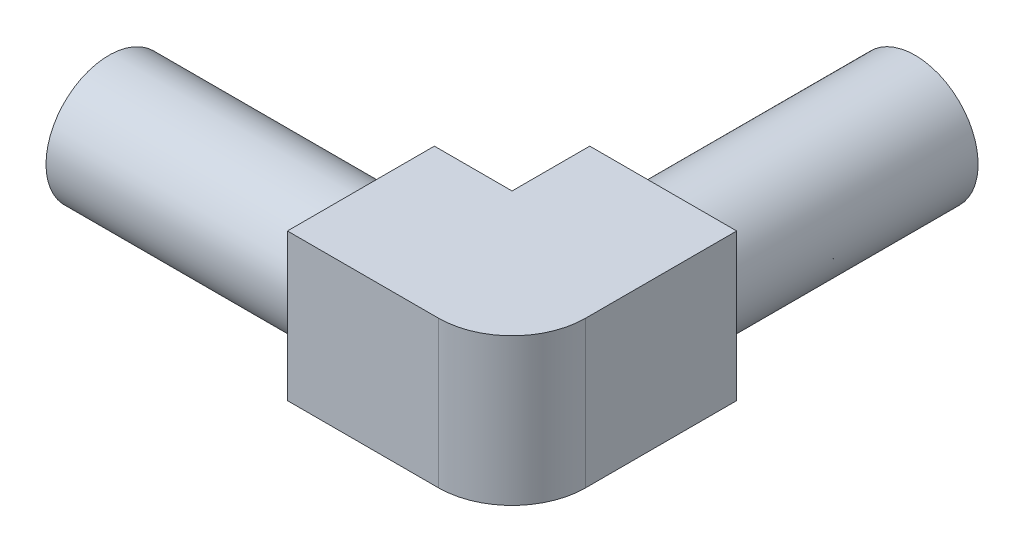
ISO-10303-21;
HEADER;
FILE_DESCRIPTION(('STEP AP214'),'2;1');
FILE_NAME('part.step','',(''),(''),'','','');
FILE_SCHEMA(('AUTOMOTIVE_DESIGN { 1 0 10303 214 1 1 1 1 }'));
ENDSEC;
DATA;
#1=APPLICATION_CONTEXT('core data for automotive mechanical design processes');
#2=APPLICATION_PROTOCOL_DEFINITION('international standard','automotive_design',2000,#1);
#3=PRODUCT_CONTEXT('',#1,'mechanical');
#4=PRODUCT('Part','Part','',(#3));
#5=PRODUCT_RELATED_PRODUCT_CATEGORY('part','',(#4));
#6=PRODUCT_DEFINITION_FORMATION('','',#4);
#7=PRODUCT_DEFINITION_CONTEXT('part definition',#1,'design');
#8=PRODUCT_DEFINITION('design','',#6,#7);
#9=PRODUCT_DEFINITION_SHAPE('','',#8);
#10=(LENGTH_UNIT() NAMED_UNIT(*) SI_UNIT(.MILLI.,.METRE.));
#11=(NAMED_UNIT(*) PLANE_ANGLE_UNIT() SI_UNIT($,.RADIAN.));
#12=(NAMED_UNIT(*) SI_UNIT($,.STERADIAN.) SOLID_ANGLE_UNIT());
#13=UNCERTAINTY_MEASURE_WITH_UNIT(LENGTH_MEASURE(1.E-05),#10,'distance_accuracy_value','');
#14=(GEOMETRIC_REPRESENTATION_CONTEXT(3) GLOBAL_UNCERTAINTY_ASSIGNED_CONTEXT((#13)) GLOBAL_UNIT_ASSIGNED_CONTEXT((#10,
#11,#12)) REPRESENTATION_CONTEXT('',''));
#15=CARTESIAN_POINT('',(0.,0.,0.));
#16=DIRECTION('',(0.,0.,1.));
#17=DIRECTION('',(1.,0.,0.));
#18=AXIS2_PLACEMENT_3D('',#15,#16,#17);
#19=CARTESIAN_POINT('',(30.48,0.,0.));
#20=DIRECTION('',(0.,-1.,0.));
#21=DIRECTION('',(0.,0.,-1.));
#22=AXIS2_PLACEMENT_3D('',#19,#20,#21);
#23=CYLINDRICAL_SURFACE('',#22,5.55625);
#24=DIRECTION('',(0.,1.,0.));
#25=VECTOR('',#24,1.);
#26=CARTESIAN_POINT('',(36.03625,-5.55625000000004,0.));
#27=LINE('',#26,#25);
#28=CARTESIAN_POINT('',(36.0362500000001,5.55624999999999,0.));
#29=VERTEX_POINT('',#28);
#30=CARTESIAN_POINT('',(36.0362500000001,-5.55625000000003,0.));
#31=VERTEX_POINT('',#30);
#32=EDGE_CURVE('E60',#29,#31,#27,.F.);
#33=ORIENTED_EDGE('',*,*,#32,.F.);
#34=CARTESIAN_POINT('',(30.48,5.55624999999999,0.));
#35=DIRECTION('',(0.,-1.,0.));
#36=DIRECTION('',(0.,0.,-1.));
#37=AXIS2_PLACEMENT_3D('',#34,#35,#36);
#38=CIRCLE('',#37,5.55625);
#39=CARTESIAN_POINT('',(30.48,5.55624999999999,5.55625));
#40=VERTEX_POINT('',#39);
#41=EDGE_CURVE('E89',#40,#29,#38,.F.);
#42=ORIENTED_EDGE('',*,*,#41,.F.);
#43=DIRECTION('',(0.,-1.,0.));
#44=VECTOR('',#43,1.);
#45=CARTESIAN_POINT('',(30.48,-5.55625000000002,5.55625));
#46=LINE('',#45,#44);
#47=CARTESIAN_POINT('',(30.48,-5.55625000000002,5.55625));
#48=VERTEX_POINT('',#47);
#49=EDGE_CURVE('E81',#48,#40,#46,.F.);
#50=ORIENTED_EDGE('',*,*,#49,.F.);
#51=CARTESIAN_POINT('',(30.48,-5.55625000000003,0.));
#52=DIRECTION('',(0.,-1.,0.));
#53=DIRECTION('',(0.,0.,-1.));
#54=AXIS2_PLACEMENT_3D('',#51,#52,#53);
#55=CIRCLE('',#54,5.55625);
#56=EDGE_CURVE('E19',#31,#48,#55,.T.);
#57=ORIENTED_EDGE('',*,*,#56,.F.);
#58=EDGE_LOOP('',(#33,#42,#50,#57));
#59=FACE_BOUND('',#58,.T.);
#60=ADVANCED_FACE('F16',(#59),#23,.T.);
#61=CARTESIAN_POINT('',(24.92375,5.55624999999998,0.));
#62=DIRECTION('',(-1.,0.,0.));
#63=DIRECTION('',(0.,0.,1.));
#64=AXIS2_PLACEMENT_3D('',#61,#62,#63);
#65=PLANE('',#64);
#66=DIRECTION('',(0.,1.,0.));
#67=VECTOR('',#66,1.);
#68=CARTESIAN_POINT('',(24.92375,0.,-11.43));
#69=LINE('',#68,#67);
#70=CARTESIAN_POINT('',(24.92375,-5.55625000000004,-11.43));
#71=VERTEX_POINT('',#70);
#72=CARTESIAN_POINT('',(24.92375,5.55624999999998,-11.43));
#73=VERTEX_POINT('',#72);
#74=EDGE_CURVE('E123',#71,#73,#69,.T.);
#75=ORIENTED_EDGE('',*,*,#74,.F.);
#76=DIRECTION('',(0.,0.,1.));
#77=VECTOR('',#76,1.);
#78=CARTESIAN_POINT('',(24.92375,-5.55625000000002,-5.55624999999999));
#79=LINE('',#78,#77);
#80=CARTESIAN_POINT('',(24.92375,-5.55625000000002,-5.55624999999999));
#81=VERTEX_POINT('',#80);
#82=EDGE_CURVE('E102',#81,#71,#79,.F.);
#83=ORIENTED_EDGE('',*,*,#82,.F.);
#84=DIRECTION('',(0.,1.,0.));
#85=VECTOR('',#84,1.);
#86=CARTESIAN_POINT('',(24.92375,5.55625,-5.55625));
#87=LINE('',#86,#85);
#88=CARTESIAN_POINT('',(24.92375,5.55625,-5.55625));
#89=VERTEX_POINT('',#88);
#90=EDGE_CURVE('E177',#89,#81,#87,.F.);
#91=ORIENTED_EDGE('',*,*,#90,.F.);
#92=DIRECTION('',(0.,0.,1.));
#93=VECTOR('',#92,1.);
#94=CARTESIAN_POINT('',(24.92375,5.55624999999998,5.55625));
#95=LINE('',#94,#93);
#96=EDGE_CURVE('E98',#73,#89,#95,.T.);
#97=ORIENTED_EDGE('',*,*,#96,.F.);
#98=EDGE_LOOP('',(#75,#83,#91,#97));
#99=FACE_BOUND('',#98,.T.);
#100=ADVANCED_FACE('F218',(#99),#65,.T.);
#101=CARTESIAN_POINT('',(36.03625,-5.55625000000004,0.));
#102=DIRECTION('',(1.,0.,0.));
#103=DIRECTION('',(0.,0.,-1.));
#104=AXIS2_PLACEMENT_3D('',#101,#102,#103);
#105=PLANE('',#104);
#106=ORIENTED_EDGE('',*,*,#32,.T.);
#107=DIRECTION('',(0.,0.,1.));
#108=VECTOR('',#107,1.);
#109=CARTESIAN_POINT('',(36.03625,-5.55625000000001,-5.55624999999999));
#110=LINE('',#109,#108);
#111=CARTESIAN_POINT('',(36.03625,-5.55625000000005,-11.43));
#112=VERTEX_POINT('',#111);
#113=EDGE_CURVE('E74',#112,#31,#110,.T.);
#114=ORIENTED_EDGE('',*,*,#113,.F.);
#115=DIRECTION('',(0.,1.,0.));
#116=VECTOR('',#115,1.);
#117=CARTESIAN_POINT('',(36.03625,0.,-11.43));
#118=LINE('',#117,#116);
#119=CARTESIAN_POINT('',(36.03625,5.55624999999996,-11.43));
#120=VERTEX_POINT('',#119);
#121=EDGE_CURVE('E122',#120,#112,#118,.F.);
#122=ORIENTED_EDGE('',*,*,#121,.F.);
#123=DIRECTION('',(0.,0.,1.));
#124=VECTOR('',#123,1.);
#125=CARTESIAN_POINT('',(36.03625,5.55625,5.55625));
#126=LINE('',#125,#124);
#127=EDGE_CURVE('E91',#29,#120,#126,.F.);
#128=ORIENTED_EDGE('',*,*,#127,.F.);
#129=EDGE_LOOP('',(#106,#114,#122,#128));
#130=FACE_BOUND('',#129,.T.);
#131=ADVANCED_FACE('F349',(#130),#105,.T.);
#132=CARTESIAN_POINT('',(19.05,-5.55625,-5.55625));
#133=DIRECTION('',(0.,-1.,0.));
#134=DIRECTION('',(1.,0.,0.));
#135=AXIS2_PLACEMENT_3D('',#132,#133,#134);
#136=PLANE('',#135);
#137=ORIENTED_EDGE('',*,*,#113,.T.);
#138=ORIENTED_EDGE('',*,*,#56,.T.);
#139=DIRECTION('',(1.,0.,0.));
#140=VECTOR('',#139,1.);
#141=CARTESIAN_POINT('',(19.05,-5.55625000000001,5.55625));
#142=LINE('',#141,#140);
#143=CARTESIAN_POINT('',(19.05,-5.55625000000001,5.55625));
#144=VERTEX_POINT('',#143);
#145=EDGE_CURVE('E71',#144,#48,#142,.T.);
#146=ORIENTED_EDGE('',*,*,#145,.F.);
#147=DIRECTION('',(0.,0.,1.));
#148=VECTOR('',#147,1.);
#149=CARTESIAN_POINT('',(19.05,-5.55625000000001,-2.77812499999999));
#150=LINE('',#149,#148);
#151=CARTESIAN_POINT('',(19.05,-5.55625,-5.55625));
#152=VERTEX_POINT('',#151);
#153=EDGE_CURVE('E107',#152,#144,#150,.T.);
#154=ORIENTED_EDGE('',*,*,#153,.F.);
#155=DIRECTION('',(-1.,0.,0.));
#156=VECTOR('',#155,1.);
#157=CARTESIAN_POINT('',(19.05,-5.55625,-5.55625));
#158=LINE('',#157,#156);
#159=EDGE_CURVE('E183',#81,#152,#158,.T.);
#160=ORIENTED_EDGE('',*,*,#159,.F.);
#161=ORIENTED_EDGE('',*,*,#82,.T.);
#162=DIRECTION('',(-1.,0.,0.));
#163=VECTOR('',#162,1.);
#164=CARTESIAN_POINT('',(33.258125,-5.55625000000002,-11.43));
#165=LINE('',#164,#163);
#166=EDGE_CURVE('E138',#112,#71,#165,.T.);
#167=ORIENTED_EDGE('',*,*,#166,.F.);
#168=EDGE_LOOP('',(#137,#138,#146,#154,#160,#161,#167));
#169=FACE_BOUND('',#168,.T.);
#170=ADVANCED_FACE('F68',(#169),#136,.T.);
#171=CARTESIAN_POINT('',(19.05,-5.55625000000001,5.55625));
#172=DIRECTION('',(0.,0.,1.));
#173=DIRECTION('',(0.,-1.,0.));
#174=AXIS2_PLACEMENT_3D('',#171,#172,#173);
#175=PLANE('',#174);
#176=ORIENTED_EDGE('',*,*,#49,.T.);
#177=DIRECTION('',(1.,0.,0.));
#178=VECTOR('',#177,1.);
#179=CARTESIAN_POINT('',(19.05,5.55625,5.55625));
#180=LINE('',#179,#178);
#181=CARTESIAN_POINT('',(19.05,5.55625,5.55625));
#182=VERTEX_POINT('',#181);
#183=EDGE_CURVE('E178',#182,#40,#180,.T.);
#184=ORIENTED_EDGE('',*,*,#183,.F.);
#185=DIRECTION('',(0.,1.,0.));
#186=VECTOR('',#185,1.);
#187=CARTESIAN_POINT('',(19.05,0.,5.55625));
#188=LINE('',#187,#186);
#189=EDGE_CURVE('E84',#144,#182,#188,.T.);
#190=ORIENTED_EDGE('',*,*,#189,.F.);
#191=ORIENTED_EDGE('',*,*,#145,.T.);
#192=EDGE_LOOP('',(#176,#184,#190,#191));
#193=FACE_BOUND('',#192,.T.);
#194=ADVANCED_FACE('F79',(#193),#175,.T.);
#195=CARTESIAN_POINT('',(19.05,5.55625,5.55625));
#196=DIRECTION('',(0.,1.,0.));
#197=DIRECTION('',(0.,0.,1.));
#198=AXIS2_PLACEMENT_3D('',#195,#196,#197);
#199=PLANE('',#198);
#200=ORIENTED_EDGE('',*,*,#183,.T.);
#201=ORIENTED_EDGE('',*,*,#41,.T.);
#202=ORIENTED_EDGE('',*,*,#127,.T.);
#203=DIRECTION('',(-1.,0.,0.));
#204=VECTOR('',#203,1.);
#205=CARTESIAN_POINT('',(33.258125,5.55624999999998,-11.43));
#206=LINE('',#205,#204);
#207=EDGE_CURVE('E118',#73,#120,#206,.F.);
#208=ORIENTED_EDGE('',*,*,#207,.F.);
#209=ORIENTED_EDGE('',*,*,#96,.T.);
#210=DIRECTION('',(-1.,0.,0.));
#211=VECTOR('',#210,1.);
#212=CARTESIAN_POINT('',(19.05,5.55625000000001,-5.55625));
#213=LINE('',#212,#211);
#214=CARTESIAN_POINT('',(19.05,5.55625000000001,-5.55625));
#215=VERTEX_POINT('',#214);
#216=EDGE_CURVE('E142',#215,#89,#213,.F.);
#217=ORIENTED_EDGE('',*,*,#216,.F.);
#218=DIRECTION('',(0.,0.,1.));
#219=VECTOR('',#218,1.);
#220=CARTESIAN_POINT('',(19.05,5.55624999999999,-2.778125));
#221=LINE('',#220,#219);
#222=EDGE_CURVE('E106',#182,#215,#221,.F.);
#223=ORIENTED_EDGE('',*,*,#222,.F.);
#224=EDGE_LOOP('',(#200,#201,#202,#208,#209,#217,#223));
#225=FACE_BOUND('',#224,.T.);
#226=ADVANCED_FACE('F245',(#225),#199,.T.);
#227=CARTESIAN_POINT('',(19.05,5.55625000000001,-5.55625));
#228=DIRECTION('',(0.,0.,-1.));
#229=DIRECTION('',(-1.,0.,0.));
#230=AXIS2_PLACEMENT_3D('',#227,#228,#229);
#231=PLANE('',#230);
#232=DIRECTION('',(0.,1.,0.));
#233=VECTOR('',#232,1.);
#234=CARTESIAN_POINT('',(19.05,0.,-5.55625));
#235=LINE('',#234,#233);
#236=EDGE_CURVE('E113',#215,#152,#235,.F.);
#237=ORIENTED_EDGE('',*,*,#236,.F.);
#238=ORIENTED_EDGE('',*,*,#216,.T.);
#239=ORIENTED_EDGE('',*,*,#90,.T.);
#240=ORIENTED_EDGE('',*,*,#159,.T.);
#241=EDGE_LOOP('',(#237,#238,#239,#240));
#242=FACE_BOUND('',#241,.T.);
#243=ADVANCED_FACE('F230',(#242),#231,.T.);
#244=CARTESIAN_POINT('',(33.258125,0.,-11.43));
#245=DIRECTION('',(0.,0.,-1.));
#246=DIRECTION('',(-1.,0.,0.));
#247=AXIS2_PLACEMENT_3D('',#244,#245,#246);
#248=PLANE('',#247);
#249=ORIENTED_EDGE('',*,*,#207,.T.);
#250=ORIENTED_EDGE('',*,*,#121,.T.);
#251=ORIENTED_EDGE('',*,*,#166,.T.);
#252=ORIENTED_EDGE('',*,*,#74,.T.);
#253=EDGE_LOOP('',(#249,#250,#251,#252));
#254=FACE_BOUND('',#253,.T.);
#255=CARTESIAN_POINT('',(30.48,0.,-11.43));
#256=DIRECTION('',(0.,0.,-1.));
#257=DIRECTION('',(-1.,0.,0.));
#258=AXIS2_PLACEMENT_3D('',#255,#256,#257);
#259=CIRCLE('',#258,4.7625);
#260=CARTESIAN_POINT('',(25.7175,0.,-11.43));
#261=VERTEX_POINT('',#260);
#262=EDGE_CURVE('E174',#261,#261,#259,.T.);
#263=ORIENTED_EDGE('',*,*,#262,.F.);
#264=EDGE_LOOP('',(#263));
#265=FACE_BOUND('',#264,.T.);
#266=ADVANCED_FACE('F214',(#254,#265),#248,.T.);
#267=CARTESIAN_POINT('',(19.05,0.,-2.778125));
#268=DIRECTION('',(-1.,0.,0.));
#269=DIRECTION('',(0.,0.,1.));
#270=AXIS2_PLACEMENT_3D('',#267,#268,#269);
#271=PLANE('',#270);
#272=ORIENTED_EDGE('',*,*,#222,.T.);
#273=ORIENTED_EDGE('',*,*,#236,.T.);
#274=ORIENTED_EDGE('',*,*,#153,.T.);
#275=ORIENTED_EDGE('',*,*,#189,.T.);
#276=EDGE_LOOP('',(#272,#273,#274,#275));
#277=FACE_BOUND('',#276,.T.);
#278=CARTESIAN_POINT('',(19.05,0.,0.));
#279=DIRECTION('',(-1.,0.,0.));
#280=DIRECTION('',(0.,0.,1.));
#281=AXIS2_PLACEMENT_3D('',#278,#279,#280);
#282=CIRCLE('',#281,4.7625);
#283=CARTESIAN_POINT('',(19.05,0.,4.7625));
#284=VERTEX_POINT('',#283);
#285=EDGE_CURVE('E170',#284,#284,#282,.T.);
#286=ORIENTED_EDGE('',*,*,#285,.F.);
#287=EDGE_LOOP('',(#286));
#288=FACE_BOUND('',#287,.T.);
#289=ADVANCED_FACE('F236',(#277,#288),#271,.T.);
#290=CARTESIAN_POINT('',(30.4800000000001,0.,-20.955));
#291=DIRECTION('',(0.,0.,-1.));
#292=DIRECTION('',(-1.,0.,0.));
#293=AXIS2_PLACEMENT_3D('',#290,#291,#292);
#294=CYLINDRICAL_SURFACE('',#293,4.7625);
#295=CARTESIAN_POINT('',(30.4800000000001,0.,-30.48));
#296=DIRECTION('',(0.,0.,-1.));
#297=DIRECTION('',(-1.,0.,0.));
#298=AXIS2_PLACEMENT_3D('',#295,#296,#297);
#299=CIRCLE('',#298,4.7625);
#300=CARTESIAN_POINT('',(25.7175000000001,0.,-30.48));
#301=VERTEX_POINT('',#300);
#302=EDGE_CURVE('E166',#301,#301,#299,.T.);
#303=ORIENTED_EDGE('',*,*,#302,.F.);
#304=EDGE_LOOP('',(#303));
#305=FACE_BOUND('',#304,.T.);
#306=ORIENTED_EDGE('',*,*,#262,.T.);
#307=EDGE_LOOP('',(#306));
#308=FACE_BOUND('',#307,.T.);
#309=ADVANCED_FACE('F289',(#305,#308),#294,.T.);
#310=CARTESIAN_POINT('',(9.525,0.,0.));
#311=DIRECTION('',(-1.,0.,0.));
#312=DIRECTION('',(0.,0.,1.));
#313=AXIS2_PLACEMENT_3D('',#310,#311,#312);
#314=CYLINDRICAL_SURFACE('',#313,4.7625);
#315=CARTESIAN_POINT('',(0.,0.,0.));
#316=DIRECTION('',(-1.,0.,0.));
#317=DIRECTION('',(0.,0.,1.));
#318=AXIS2_PLACEMENT_3D('',#315,#316,#317);
#319=CIRCLE('',#318,4.7625);
#320=CARTESIAN_POINT('',(0.,0.,4.7625));
#321=VERTEX_POINT('',#320);
#322=EDGE_CURVE('E162',#321,#321,#319,.T.);
#323=ORIENTED_EDGE('',*,*,#322,.F.);
#324=EDGE_LOOP('',(#323));
#325=FACE_BOUND('',#324,.T.);
#326=ORIENTED_EDGE('',*,*,#285,.T.);
#327=EDGE_LOOP('',(#326));
#328=FACE_BOUND('',#327,.T.);
#329=ADVANCED_FACE('F278',(#325,#328),#314,.T.);
#330=CARTESIAN_POINT('',(32.86125,0.,-30.48));
#331=DIRECTION('',(0.,0.,-1.));
#332=DIRECTION('',(-1.,0.,0.));
#333=AXIS2_PLACEMENT_3D('',#330,#331,#332);
#334=PLANE('',#333);
#335=ORIENTED_EDGE('',*,*,#302,.T.);
#336=EDGE_LOOP('',(#335));
#337=FACE_BOUND('',#336,.T.);
#338=CARTESIAN_POINT('',(30.4800000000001,0.,-30.48));
#339=DIRECTION('',(0.,0.,1.));
#340=DIRECTION('',(1.,0.,0.));
#341=AXIS2_PLACEMENT_3D('',#338,#339,#340);
#342=CIRCLE('',#341,3.8735);
#343=CARTESIAN_POINT('',(34.3535000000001,0.,-30.48));
#344=VERTEX_POINT('',#343);
#345=EDGE_CURVE('E156',#344,#344,#342,.T.);
#346=ORIENTED_EDGE('',*,*,#345,.T.);
#347=EDGE_LOOP('',(#346));
#348=FACE_BOUND('',#347,.T.);
#349=ADVANCED_FACE('F276',(#337,#348),#334,.T.);
#350=CARTESIAN_POINT('',(0.,0.,-2.38125));
#351=DIRECTION('',(-1.,0.,0.));
#352=DIRECTION('',(0.,0.,1.));
#353=AXIS2_PLACEMENT_3D('',#350,#351,#352);
#354=PLANE('',#353);
#355=ORIENTED_EDGE('',*,*,#322,.T.);
#356=EDGE_LOOP('',(#355));
#357=FACE_BOUND('',#356,.T.);
#358=CARTESIAN_POINT('',(0.,0.,0.));
#359=DIRECTION('',(1.,0.,0.));
#360=DIRECTION('',(0.,0.,-1.));
#361=AXIS2_PLACEMENT_3D('',#358,#359,#360);
#362=CIRCLE('',#361,3.8735);
#363=CARTESIAN_POINT('',(0.,0.,-3.8735));
#364=VERTEX_POINT('',#363);
#365=EDGE_CURVE('E148',#364,#364,#362,.T.);
#366=ORIENTED_EDGE('',*,*,#365,.T.);
#367=EDGE_LOOP('',(#366));
#368=FACE_BOUND('',#367,.T.);
#369=ADVANCED_FACE('F265',(#357,#368),#354,.T.);
#370=CARTESIAN_POINT('',(30.48,0.,0.));
#371=DIRECTION('',(0.939102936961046,0.209353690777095,0.27250083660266));
#372=DIRECTION('',(-0.124895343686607,0.946704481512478,-0.296903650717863));
#373=AXIS2_PLACEMENT_3D('',#370,#371,#372);
#374=SPHERICAL_SURFACE('',#373,3.8735);
#375=CARTESIAN_POINT('',(34.1176152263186,0.810931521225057,1.05553199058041));
#376=VERTEX_POINT('',#375);
#377=VERTEX_LOOP('',#376);
#378=FACE_BOUND('',#377,.T.);
#379=CARTESIAN_POINT('',(30.48,0.,0.));
#380=DIRECTION('',(1.,0.,0.));
#381=DIRECTION('',(0.,0.,-1.));
#382=AXIS2_PLACEMENT_3D('',#379,#380,#381);
#383=CIRCLE('',#382,3.8735);
#384=CARTESIAN_POINT('',(30.48,-3.87350000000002,0.));
#385=VERTEX_POINT('',#384);
#386=CARTESIAN_POINT('',(30.48,3.87349999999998,0.));
#387=VERTEX_POINT('',#386);
#388=EDGE_CURVE('E26',#385,#387,#383,.F.);
#389=ORIENTED_EDGE('',*,*,#388,.T.);
#390=CARTESIAN_POINT('',(30.48,0.,0.));
#391=DIRECTION('',(0.,0.,1.));
#392=DIRECTION('',(1.,0.,0.));
#393=AXIS2_PLACEMENT_3D('',#390,#391,#392);
#394=CIRCLE('',#393,3.8735);
#395=EDGE_CURVE('E37',#387,#385,#394,.F.);
#396=ORIENTED_EDGE('',*,*,#395,.T.);
#397=EDGE_LOOP('',(#389,#396));
#398=FACE_BOUND('',#397,.T.);
#399=ADVANCED_FACE('F261',(#378,#398),#374,.F.);
#400=CARTESIAN_POINT('',(30.4800000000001,0.,-15.24));
#401=DIRECTION('',(0.,0.,1.));
#402=DIRECTION('',(1.,0.,0.));
#403=AXIS2_PLACEMENT_3D('',#400,#401,#402);
#404=CYLINDRICAL_SURFACE('',#403,3.8735);
#405=CARTESIAN_POINT('',(30.48,0.,0.));
#406=DIRECTION('',(-0.707106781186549,0.,0.707106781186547));
#407=DIRECTION('',(0.707106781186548,0.,0.707106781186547));
#408=AXIS2_PLACEMENT_3D('',#405,#406,#407);
#409=ELLIPSE('',#408,5.47795623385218,3.8735);
#410=EDGE_CURVE('E11',#387,#385,#409,.T.);
#411=ORIENTED_EDGE('',*,*,#410,.T.);
#412=ORIENTED_EDGE('',*,*,#395,.F.);
#413=EDGE_LOOP('',(#411,#412));
#414=FACE_BOUND('',#413,.T.);
#415=ORIENTED_EDGE('',*,*,#345,.F.);
#416=EDGE_LOOP('',(#415));
#417=FACE_BOUND('',#416,.T.);
#418=ADVANCED_FACE('F264',(#414,#417),#404,.F.);
#419=CARTESIAN_POINT('',(15.24,0.,0.));
#420=DIRECTION('',(1.,0.,0.));
#421=DIRECTION('',(0.,0.,-1.));
#422=AXIS2_PLACEMENT_3D('',#419,#420,#421);
#423=CYLINDRICAL_SURFACE('',#422,3.8735);
#424=ORIENTED_EDGE('',*,*,#388,.F.);
#425=ORIENTED_EDGE('',*,*,#410,.F.);
#426=EDGE_LOOP('',(#424,#425));
#427=FACE_BOUND('',#426,.T.);
#428=ORIENTED_EDGE('',*,*,#365,.F.);
#429=EDGE_LOOP('',(#428));
#430=FACE_BOUND('',#429,.T.);
#431=ADVANCED_FACE('F269',(#427,#430),#423,.F.);
#432=CLOSED_SHELL('',(#60,#100,#131,#170,#194,#226,#243,#266,#289,#309,#329,#349,#369,#399,#418,#431));
#433=MANIFOLD_SOLID_BREP('B1',#432);
#434=ADVANCED_BREP_SHAPE_REPRESENTATION('',(#18,#433),#14);
#435=SHAPE_DEFINITION_REPRESENTATION(#9,#434);
ENDSEC;
END-ISO-10303-21;
